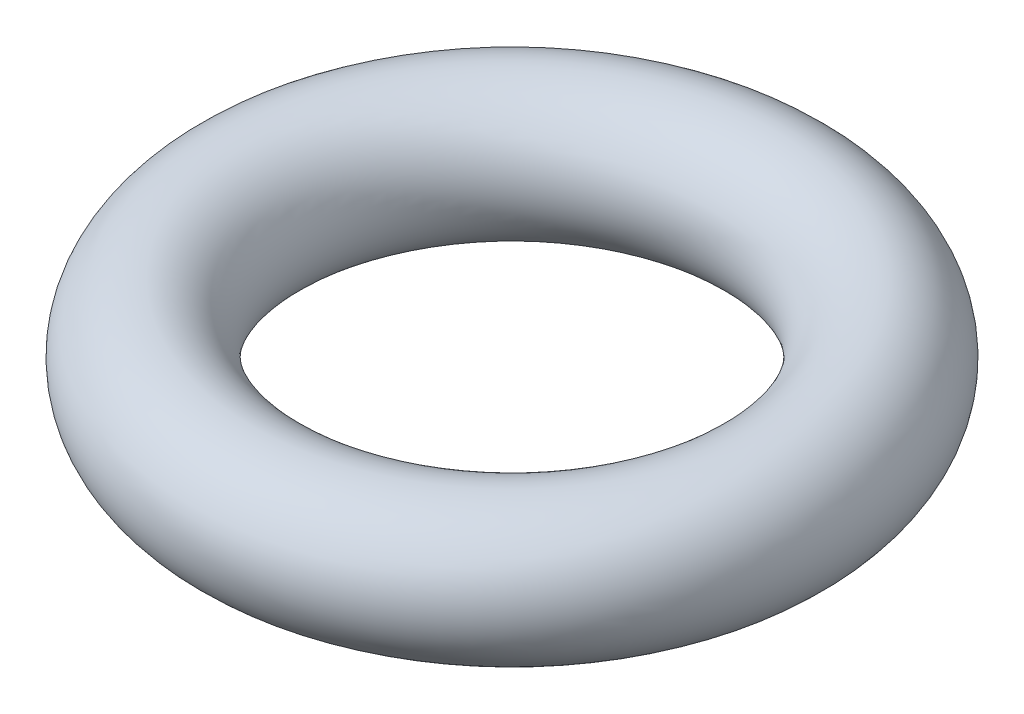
from build123d import *

# Parameters (mm, degrees)
SCHIZZO2_R = 2.5


with BuildPart() as part:
    # Sweep1: sweep along a path in Schizzo1
    with BuildLine(Plane(origin=(0, 0, 0), x_dir=(1, 0, 0), z_dir=(0, 1, 0))) as sweep1_path:
        CenterArc((0, 0), 9.5, 0, 360)
    # Schizzo2 → Sweep1 (sweep)
    with BuildSketch(Plane.XY):
        with Locations((9.5, 0)):
            Circle(SCHIZZO2_R)
    sweep(path=sweep1_path.line)


solid = part.part
